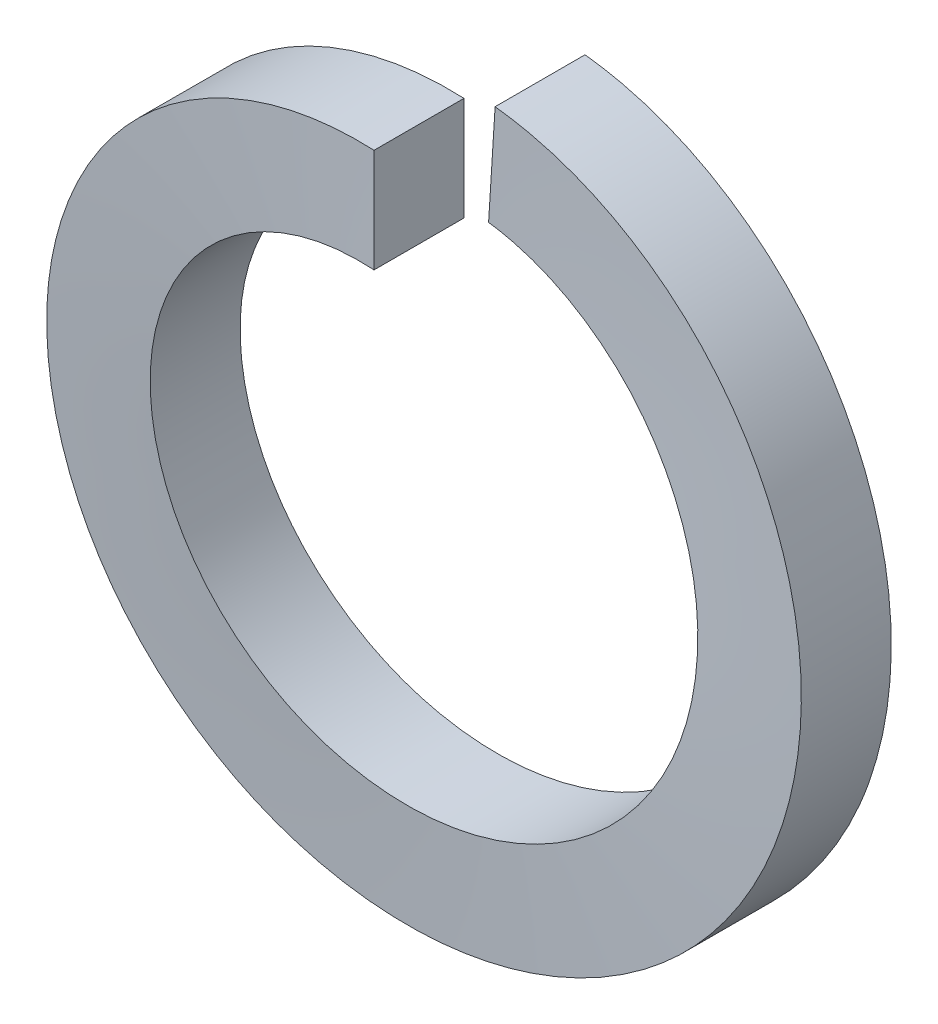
from build123d import *

# Parameters (mm, degrees)
SWEEP1_PITCH       = 2.555555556
SWEEP1_HEIGHT      = 2.53
SWEEP1_RADIUS      = 9
SWEEP1_START_ANGLE = 90
SKETCH2_W          = 2.3
SKETCH2_H          = 2.65


with BuildPart() as part:
    # Sweep1: sweep along a helix
    with BuildLine() as sweep1_path:
        add(Helix(SWEEP1_PITCH, SWEEP1_HEIGHT, SWEEP1_RADIUS, center=(0, 0, 0), direction=(0, 0, -1), lefthand=True, mode=Mode.PRIVATE).rotate(Axis((0, 0, 0), (0, 0, -1)), SWEEP1_START_ANGLE))
    # Sketch2 → Sweep1 (sweep)
    with BuildSketch(Plane(origin=(0, 0, 0), x_dir=(0, 0, -1), z_dir=(1, 0, 0))):
        with Locations((-1.15, 7.675)):
            Rectangle(SKETCH2_W, SKETCH2_H)
    sweep(path=sweep1_path.line, is_frenet=True)


solid = part.part
